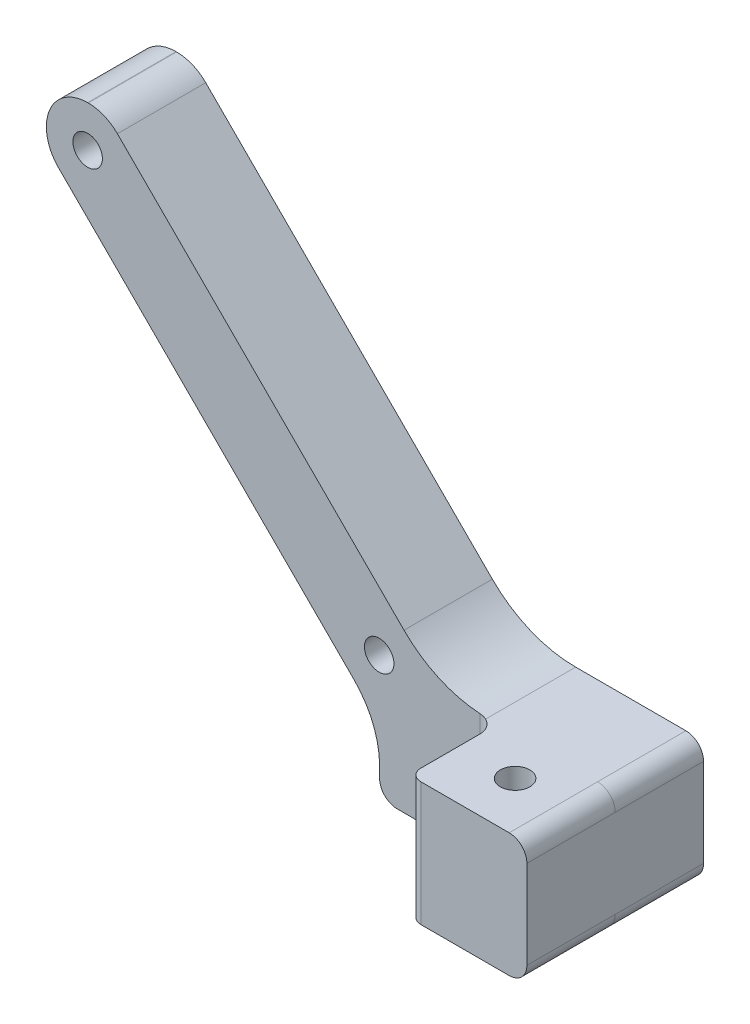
ISO-10303-21;
HEADER;
FILE_DESCRIPTION(('STEP AP214'),'2;1');
FILE_NAME('part.step','',(''),(''),'','','');
FILE_SCHEMA(('AUTOMOTIVE_DESIGN { 1 0 10303 214 1 1 1 1 }'));
ENDSEC;
DATA;
#1=APPLICATION_CONTEXT('core data for automotive mechanical design processes');
#2=APPLICATION_PROTOCOL_DEFINITION('international standard','automotive_design',2000,#1);
#3=PRODUCT_CONTEXT('',#1,'mechanical');
#4=PRODUCT('Part','Part','',(#3));
#5=PRODUCT_RELATED_PRODUCT_CATEGORY('part','',(#4));
#6=PRODUCT_DEFINITION_FORMATION('','',#4);
#7=PRODUCT_DEFINITION_CONTEXT('part definition',#1,'design');
#8=PRODUCT_DEFINITION('design','',#6,#7);
#9=PRODUCT_DEFINITION_SHAPE('','',#8);
#10=(LENGTH_UNIT() NAMED_UNIT(*) SI_UNIT(.MILLI.,.METRE.));
#11=(NAMED_UNIT(*) PLANE_ANGLE_UNIT() SI_UNIT($,.RADIAN.));
#12=(NAMED_UNIT(*) SI_UNIT($,.STERADIAN.) SOLID_ANGLE_UNIT());
#13=UNCERTAINTY_MEASURE_WITH_UNIT(LENGTH_MEASURE(1.E-05),#10,'distance_accuracy_value','');
#14=(GEOMETRIC_REPRESENTATION_CONTEXT(3) GLOBAL_UNCERTAINTY_ASSIGNED_CONTEXT((#13)) GLOBAL_UNIT_ASSIGNED_CONTEXT((#10,
#11,#12)) REPRESENTATION_CONTEXT('',''));
#15=CARTESIAN_POINT('',(0.,0.,0.));
#16=DIRECTION('',(0.,0.,1.));
#17=DIRECTION('',(1.,0.,0.));
#18=AXIS2_PLACEMENT_3D('',#15,#16,#17);
#19=CARTESIAN_POINT('',(-20.,21.,7.5));
#20=DIRECTION('',(0.,0.,-1.));
#21=DIRECTION('',(-1.,0.,0.));
#22=AXIS2_PLACEMENT_3D('',#19,#20,#21);
#23=PLANE('',#22);
#24=CARTESIAN_POINT('',(-69.568542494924,70.5685424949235,7.5));
#25=DIRECTION('',(0.,0.,1.));
#26=DIRECTION('',(1.,0.,0.));
#27=AXIS2_PLACEMENT_3D('',#24,#25,#26);
#28=CIRCLE('',#27,2.50000000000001);
#29=CARTESIAN_POINT('',(-67.068542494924,70.5685424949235,7.5));
#30=VERTEX_POINT('',#29);
#31=EDGE_CURVE('E467',#30,#30,#28,.T.);
#32=ORIENTED_EDGE('',*,*,#31,.F.);
#33=EDGE_LOOP('',(#32));
#34=FACE_BOUND('',#33,.T.);
#35=CARTESIAN_POINT('',(-20.0710678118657,21.0710678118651,7.5));
#36=DIRECTION('',(0.,0.,-1.));
#37=DIRECTION('',(-1.,0.,0.));
#38=AXIS2_PLACEMENT_3D('',#35,#36,#37);
#39=CIRCLE('',#38,2.5);
#40=CARTESIAN_POINT('',(-17.5710678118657,21.0710678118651,7.50000000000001));
#41=VERTEX_POINT('',#40);
#42=EDGE_CURVE('E270',#41,#41,#39,.T.);
#43=ORIENTED_EDGE('',*,*,#42,.T.);
#44=EDGE_LOOP('',(#43));
#45=FACE_BOUND('',#44,.T.);
#46=DIRECTION('',(1.,0.,0.));
#47=VECTOR('',#46,1.);
#48=CARTESIAN_POINT('',(-20.,0.,7.5));
#49=LINE('',#48,#47);
#50=CARTESIAN_POINT('',(-17.,0.,7.5));
#51=VERTEX_POINT('',#50);
#52=CARTESIAN_POINT('',(-3.,0.,7.5));
#53=VERTEX_POINT('',#52);
#54=EDGE_CURVE('E410',#51,#53,#49,.T.);
#55=ORIENTED_EDGE('',*,*,#54,.T.);
#56=DIRECTION('',(0.,-1.,0.));
#57=VECTOR('',#56,1.);
#58=CARTESIAN_POINT('',(-3.,21.,7.5));
#59=LINE('',#58,#57);
#60=CARTESIAN_POINT('',(-3.,21.0412764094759,7.5));
#61=VERTEX_POINT('',#60);
#62=EDGE_CURVE('E300',#53,#61,#59,.F.);
#63=ORIENTED_EDGE('',*,*,#62,.T.);
#64=CARTESIAN_POINT('',(-1.71572875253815,41.,7.5));
#65=DIRECTION('',(0.,0.,-1.));
#66=DIRECTION('',(-1.,0.,0.));
#67=AXIS2_PLACEMENT_3D('',#64,#65,#66);
#68=CIRCLE('',#67,20.);
#69=CARTESIAN_POINT('',(-15.857864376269,26.857864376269,7.5));
#70=VERTEX_POINT('',#69);
#71=EDGE_CURVE('E267',#61,#70,#68,.T.);
#72=ORIENTED_EDGE('',*,*,#71,.T.);
#73=DIRECTION('',(-0.707106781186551,0.707106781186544,0.));
#74=VECTOR('',#73,1.);
#75=CARTESIAN_POINT('',(-9.99999999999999,21.,7.5));
#76=LINE('',#75,#74);
#77=CARTESIAN_POINT('',(-64.5182899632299,75.5182899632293,7.5));
#78=VERTEX_POINT('',#77);
#79=EDGE_CURVE('E412',#70,#78,#76,.T.);
#80=ORIENTED_EDGE('',*,*,#79,.T.);
#81=CARTESIAN_POINT('',(-69.4680374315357,70.5685424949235,7.5));
#82=DIRECTION('',(0.,0.,-1.));
#83=DIRECTION('',(-1.,0.,0.));
#84=AXIS2_PLACEMENT_3D('',#81,#82,#83);
#85=CIRCLE('',#84,7.);
#86=CARTESIAN_POINT('',(-69.4680374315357,77.5685424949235,7.5));
#87=VERTEX_POINT('',#86);
#88=EDGE_CURVE('E250',#78,#87,#85,.F.);
#89=ORIENTED_EDGE('',*,*,#88,.T.);
#90=DIRECTION('',(1.,0.,0.));
#91=VECTOR('',#90,1.);
#92=CARTESIAN_POINT('',(-66.5685424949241,77.5685424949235,7.5));
#93=LINE('',#92,#91);
#94=CARTESIAN_POINT('',(-69.5685424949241,77.5685424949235,7.5));
#95=VERTEX_POINT('',#94);
#96=EDGE_CURVE('E481',#95,#87,#93,.T.);
#97=ORIENTED_EDGE('',*,*,#96,.F.);
#98=CARTESIAN_POINT('',(-69.5685424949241,70.5685424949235,7.5));
#99=DIRECTION('',(0.,0.,-1.));
#100=DIRECTION('',(-1.,0.,0.));
#101=AXIS2_PLACEMENT_3D('',#98,#99,#100);
#102=CIRCLE('',#101,7.);
#103=CARTESIAN_POINT('',(-76.5685424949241,70.5685424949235,7.5));
#104=VERTEX_POINT('',#103);
#105=EDGE_CURVE('E245',#95,#104,#102,.F.);
#106=ORIENTED_EDGE('',*,*,#105,.T.);
#107=DIRECTION('',(0.,1.,0.));
#108=VECTOR('',#107,1.);
#109=CARTESIAN_POINT('',(-76.5685424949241,77.5685424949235,7.5));
#110=LINE('',#109,#108);
#111=CARTESIAN_POINT('',(-76.5685424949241,70.4680374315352,7.5));
#112=VERTEX_POINT('',#111);
#113=EDGE_CURVE('E478',#112,#104,#110,.T.);
#114=ORIENTED_EDGE('',*,*,#113,.F.);
#115=CARTESIAN_POINT('',(-69.5685424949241,70.4680374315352,7.5));
#116=DIRECTION('',(0.,0.,-1.));
#117=DIRECTION('',(-1.,0.,0.));
#118=AXIS2_PLACEMENT_3D('',#115,#116,#117);
#119=CIRCLE('',#118,7.);
#120=CARTESIAN_POINT('',(-74.5182899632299,65.5182899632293,7.5));
#121=VERTEX_POINT('',#120);
#122=EDGE_CURVE('E247',#112,#121,#119,.F.);
#123=ORIENTED_EDGE('',*,*,#122,.T.);
#124=DIRECTION('',(-0.707106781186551,0.707106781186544,0.));
#125=VECTOR('',#124,1.);
#126=CARTESIAN_POINT('',(-20.,11.,7.5));
#127=LINE('',#126,#125);
#128=CARTESIAN_POINT('',(-24.3933982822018,15.3933982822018,7.5));
#129=VERTEX_POINT('',#128);
#130=EDGE_CURVE('E476',#129,#121,#127,.T.);
#131=ORIENTED_EDGE('',*,*,#130,.F.);
#132=CARTESIAN_POINT('',(-35.,4.78679656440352,7.5));
#133=DIRECTION('',(0.,0.,-1.));
#134=DIRECTION('',(-1.,0.,0.));
#135=AXIS2_PLACEMENT_3D('',#132,#133,#134);
#136=CIRCLE('',#135,15.);
#137=CARTESIAN_POINT('',(-20.,4.78679656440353,7.5));
#138=VERTEX_POINT('',#137);
#139=EDGE_CURVE('E279',#129,#138,#136,.T.);
#140=ORIENTED_EDGE('',*,*,#139,.T.);
#141=DIRECTION('',(0.,-1.,0.));
#142=VECTOR('',#141,1.);
#143=CARTESIAN_POINT('',(-20.,21.,7.5));
#144=LINE('',#143,#142);
#145=CARTESIAN_POINT('',(-20.,3.00000000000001,7.5));
#146=VERTEX_POINT('',#145);
#147=EDGE_CURVE('E416',#138,#146,#144,.T.);
#148=ORIENTED_EDGE('',*,*,#147,.T.);
#149=CARTESIAN_POINT('',(-17.,3.,7.5));
#150=DIRECTION('',(0.,0.,-1.));
#151=DIRECTION('',(-1.,0.,0.));
#152=AXIS2_PLACEMENT_3D('',#149,#150,#151);
#153=CIRCLE('',#152,3.);
#154=EDGE_CURVE('E219',#146,#51,#153,.F.);
#155=ORIENTED_EDGE('',*,*,#154,.T.);
#156=EDGE_LOOP('',(#55,#63,#72,#80,#89,#97,#106,#114,#123,#131,#140,#148,#155));
#157=FACE_BOUND('',#156,.T.);
#158=ADVANCED_FACE('F34',(#34,#45,#157),#23,.F.);
#159=CARTESIAN_POINT('',(-20.,21.,-7.5));
#160=DIRECTION('',(1.,0.,0.));
#161=DIRECTION('',(0.,0.,-1.));
#162=AXIS2_PLACEMENT_3D('',#159,#160,#161);
#163=PLANE('',#162);
#164=ORIENTED_EDGE('',*,*,#147,.F.);
#165=DIRECTION('',(0.,0.,1.));
#166=VECTOR('',#165,1.);
#167=CARTESIAN_POINT('',(-20.,4.78679656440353,-7.5));
#168=LINE('',#167,#166);
#169=CARTESIAN_POINT('',(-20.,4.78679656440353,-7.5));
#170=VERTEX_POINT('',#169);
#171=EDGE_CURVE('E277',#138,#170,#168,.F.);
#172=ORIENTED_EDGE('',*,*,#171,.T.);
#173=DIRECTION('',(0.,-1.,0.));
#174=VECTOR('',#173,1.);
#175=CARTESIAN_POINT('',(-20.,21.,-7.5));
#176=LINE('',#175,#174);
#177=CARTESIAN_POINT('',(-20.,3.00000000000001,-7.5));
#178=VERTEX_POINT('',#177);
#179=EDGE_CURVE('E203',#170,#178,#176,.T.);
#180=ORIENTED_EDGE('',*,*,#179,.T.);
#181=DIRECTION('',(0.,0.,1.));
#182=VECTOR('',#181,1.);
#183=CARTESIAN_POINT('',(-20.,3.,-7.5));
#184=LINE('',#183,#182);
#185=EDGE_CURVE('E226',#178,#146,#184,.T.);
#186=ORIENTED_EDGE('',*,*,#185,.T.);
#187=EDGE_LOOP('',(#164,#172,#180,#186));
#188=FACE_BOUND('',#187,.T.);
#189=ADVANCED_FACE('F346',(#188),#163,.F.);
#190=CARTESIAN_POINT('',(20.,21.,-7.5));
#191=DIRECTION('',(-1.,0.,0.));
#192=DIRECTION('',(0.,0.,1.));
#193=AXIS2_PLACEMENT_3D('',#190,#191,#192);
#194=PLANE('',#193);
#195=DIRECTION('',(0.,0.,-1.));
#196=VECTOR('',#195,1.);
#197=CARTESIAN_POINT('',(20.,18.,7.5));
#198=LINE('',#197,#196);
#199=CARTESIAN_POINT('',(20.,18.,-7.5));
#200=VERTEX_POINT('',#199);
#201=CARTESIAN_POINT('',(20.,18.,7.5));
#202=VERTEX_POINT('',#201);
#203=EDGE_CURVE('E198',#200,#202,#198,.F.);
#204=ORIENTED_EDGE('',*,*,#203,.T.);
#205=DIRECTION('',(0.,0.,-1.));
#206=VECTOR('',#205,1.);
#207=CARTESIAN_POINT('',(20.,18.,22.5));
#208=LINE('',#207,#206);
#209=CARTESIAN_POINT('',(20.,18.,22.5));
#210=VERTEX_POINT('',#209);
#211=EDGE_CURVE('E288',#202,#210,#208,.F.);
#212=ORIENTED_EDGE('',*,*,#211,.T.);
#213=DIRECTION('',(0.,1.,0.));
#214=VECTOR('',#213,1.);
#215=CARTESIAN_POINT('',(20.,0.,22.5));
#216=LINE('',#215,#214);
#217=CARTESIAN_POINT('',(20.,3.,22.5));
#218=VERTEX_POINT('',#217);
#219=EDGE_CURVE('E453',#218,#210,#216,.T.);
#220=ORIENTED_EDGE('',*,*,#219,.F.);
#221=DIRECTION('',(0.,0.,-1.));
#222=VECTOR('',#221,1.);
#223=CARTESIAN_POINT('',(20.,3.,-7.5));
#224=LINE('',#223,#222);
#225=CARTESIAN_POINT('',(20.,3.00000000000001,7.5));
#226=VERTEX_POINT('',#225);
#227=EDGE_CURVE('E286',#218,#226,#224,.T.);
#228=ORIENTED_EDGE('',*,*,#227,.T.);
#229=DIRECTION('',(0.,0.,-1.));
#230=VECTOR('',#229,1.);
#231=CARTESIAN_POINT('',(20.,3.,-7.5));
#232=LINE('',#231,#230);
#233=CARTESIAN_POINT('',(20.,3.00000000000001,-7.5));
#234=VERTEX_POINT('',#233);
#235=EDGE_CURVE('E202',#226,#234,#232,.T.);
#236=ORIENTED_EDGE('',*,*,#235,.T.);
#237=DIRECTION('',(0.,-1.,0.));
#238=VECTOR('',#237,1.);
#239=CARTESIAN_POINT('',(20.,21.,-7.5));
#240=LINE('',#239,#238);
#241=EDGE_CURVE('E185',#200,#234,#240,.T.);
#242=ORIENTED_EDGE('',*,*,#241,.F.);
#243=EDGE_LOOP('',(#204,#212,#220,#228,#236,#242));
#244=FACE_BOUND('',#243,.T.);
#245=ADVANCED_FACE('F197',(#244),#194,.F.);
#246=CARTESIAN_POINT('',(-20.,21.,-7.5));
#247=DIRECTION('',(0.,0.,1.));
#248=DIRECTION('',(1.,0.,0.));
#249=AXIS2_PLACEMENT_3D('',#246,#247,#248);
#250=PLANE('',#249);
#251=CARTESIAN_POINT('',(-20.0710678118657,21.0710678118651,-7.5));
#252=DIRECTION('',(0.,0.,1.));
#253=DIRECTION('',(1.,0.,0.));
#254=AXIS2_PLACEMENT_3D('',#251,#252,#253);
#255=CIRCLE('',#254,2.5);
#256=CARTESIAN_POINT('',(-17.5710678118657,21.0710678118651,-7.5));
#257=VERTEX_POINT('',#256);
#258=EDGE_CURVE('E273',#257,#257,#255,.T.);
#259=ORIENTED_EDGE('',*,*,#258,.T.);
#260=EDGE_LOOP('',(#259));
#261=FACE_BOUND('',#260,.T.);
#262=CARTESIAN_POINT('',(-69.568542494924,70.5685424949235,-7.5));
#263=DIRECTION('',(0.,0.,1.));
#264=DIRECTION('',(1.,0.,0.));
#265=AXIS2_PLACEMENT_3D('',#262,#263,#264);
#266=CIRCLE('',#265,2.50000000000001);
#267=CARTESIAN_POINT('',(-67.068542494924,70.5685424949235,-7.5));
#268=VERTEX_POINT('',#267);
#269=EDGE_CURVE('E468',#268,#268,#266,.T.);
#270=ORIENTED_EDGE('',*,*,#269,.T.);
#271=EDGE_LOOP('',(#270));
#272=FACE_BOUND('',#271,.T.);
#273=DIRECTION('',(-1.,0.,0.));
#274=VECTOR('',#273,1.);
#275=CARTESIAN_POINT('',(-66.5685424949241,77.5685424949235,-7.5));
#276=LINE('',#275,#274);
#277=CARTESIAN_POINT('',(-69.4680374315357,77.5685424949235,-7.5));
#278=VERTEX_POINT('',#277);
#279=CARTESIAN_POINT('',(-69.5685424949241,77.5685424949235,-7.5));
#280=VERTEX_POINT('',#279);
#281=EDGE_CURVE('E399',#278,#280,#276,.T.);
#282=ORIENTED_EDGE('',*,*,#281,.F.);
#283=CARTESIAN_POINT('',(-69.4680374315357,70.5685424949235,-7.5));
#284=DIRECTION('',(0.,0.,1.));
#285=DIRECTION('',(1.,0.,0.));
#286=AXIS2_PLACEMENT_3D('',#283,#284,#285);
#287=CIRCLE('',#286,7.);
#288=CARTESIAN_POINT('',(-64.5182899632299,75.5182899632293,-7.5));
#289=VERTEX_POINT('',#288);
#290=EDGE_CURVE('E239',#278,#289,#287,.F.);
#291=ORIENTED_EDGE('',*,*,#290,.T.);
#292=DIRECTION('',(-0.707106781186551,0.707106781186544,0.));
#293=VECTOR('',#292,1.);
#294=CARTESIAN_POINT('',(-9.99999999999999,21.,-7.5));
#295=LINE('',#294,#293);
#296=CARTESIAN_POINT('',(-15.857864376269,26.857864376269,-7.5));
#297=VERTEX_POINT('',#296);
#298=EDGE_CURVE('E407',#297,#289,#295,.T.);
#299=ORIENTED_EDGE('',*,*,#298,.F.);
#300=CARTESIAN_POINT('',(-1.71572875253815,41.,-7.5));
#301=DIRECTION('',(0.,0.,1.));
#302=DIRECTION('',(1.,0.,0.));
#303=AXIS2_PLACEMENT_3D('',#300,#301,#302);
#304=CIRCLE('',#303,20.);
#305=CARTESIAN_POINT('',(-1.71572875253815,21.,-7.5));
#306=VERTEX_POINT('',#305);
#307=EDGE_CURVE('E265',#297,#306,#304,.T.);
#308=ORIENTED_EDGE('',*,*,#307,.T.);
#309=DIRECTION('',(-1.,0.,0.));
#310=VECTOR('',#309,1.);
#311=CARTESIAN_POINT('',(-20.,21.,-7.5));
#312=LINE('',#311,#310);
#313=CARTESIAN_POINT('',(17.,21.,-7.5));
#314=VERTEX_POINT('',#313);
#315=EDGE_CURVE('E187',#314,#306,#312,.T.);
#316=ORIENTED_EDGE('',*,*,#315,.F.);
#317=CARTESIAN_POINT('',(17.,18.,-7.5));
#318=DIRECTION('',(0.,0.,1.));
#319=DIRECTION('',(1.,0.,0.));
#320=AXIS2_PLACEMENT_3D('',#317,#318,#319);
#321=CIRCLE('',#320,3.);
#322=EDGE_CURVE('E181',#314,#200,#321,.F.);
#323=ORIENTED_EDGE('',*,*,#322,.T.);
#324=ORIENTED_EDGE('',*,*,#241,.T.);
#325=CARTESIAN_POINT('',(17.,3.,-7.5));
#326=DIRECTION('',(0.,0.,1.));
#327=DIRECTION('',(1.,0.,0.));
#328=AXIS2_PLACEMENT_3D('',#325,#326,#327);
#329=CIRCLE('',#328,3.);
#330=CARTESIAN_POINT('',(17.,0.,-7.5));
#331=VERTEX_POINT('',#330);
#332=EDGE_CURVE('E192',#234,#331,#329,.F.);
#333=ORIENTED_EDGE('',*,*,#332,.T.);
#334=DIRECTION('',(-1.,0.,0.));
#335=VECTOR('',#334,1.);
#336=CARTESIAN_POINT('',(-20.,0.,-7.5));
#337=LINE('',#336,#335);
#338=CARTESIAN_POINT('',(-17.,0.,-7.5));
#339=VERTEX_POINT('',#338);
#340=EDGE_CURVE('E406',#331,#339,#337,.T.);
#341=ORIENTED_EDGE('',*,*,#340,.T.);
#342=CARTESIAN_POINT('',(-17.,3.,-7.5));
#343=DIRECTION('',(0.,0.,1.));
#344=DIRECTION('',(1.,0.,0.));
#345=AXIS2_PLACEMENT_3D('',#342,#343,#344);
#346=CIRCLE('',#345,3.);
#347=EDGE_CURVE('E193',#339,#178,#346,.F.);
#348=ORIENTED_EDGE('',*,*,#347,.T.);
#349=ORIENTED_EDGE('',*,*,#179,.F.);
#350=CARTESIAN_POINT('',(-35.,4.78679656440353,-7.5));
#351=DIRECTION('',(0.,0.,1.));
#352=DIRECTION('',(1.,0.,0.));
#353=AXIS2_PLACEMENT_3D('',#350,#351,#352);
#354=CIRCLE('',#353,15.);
#355=CARTESIAN_POINT('',(-24.3933982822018,15.3933982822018,-7.5));
#356=VERTEX_POINT('',#355);
#357=EDGE_CURVE('E281',#170,#356,#354,.T.);
#358=ORIENTED_EDGE('',*,*,#357,.T.);
#359=DIRECTION('',(-0.707106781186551,0.707106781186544,0.));
#360=VECTOR('',#359,1.);
#361=CARTESIAN_POINT('',(-20.,11.,-7.5));
#362=LINE('',#361,#360);
#363=CARTESIAN_POINT('',(-74.5182899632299,65.5182899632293,-7.5));
#364=VERTEX_POINT('',#363);
#365=EDGE_CURVE('E474',#356,#364,#362,.T.);
#366=ORIENTED_EDGE('',*,*,#365,.T.);
#367=CARTESIAN_POINT('',(-69.5685424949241,70.4680374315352,-7.5));
#368=DIRECTION('',(0.,0.,1.));
#369=DIRECTION('',(1.,0.,0.));
#370=AXIS2_PLACEMENT_3D('',#367,#368,#369);
#371=CIRCLE('',#370,7.);
#372=CARTESIAN_POINT('',(-76.5685424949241,70.4680374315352,-7.5));
#373=VERTEX_POINT('',#372);
#374=EDGE_CURVE('E237',#364,#373,#371,.F.);
#375=ORIENTED_EDGE('',*,*,#374,.T.);
#376=DIRECTION('',(0.,-1.,0.));
#377=VECTOR('',#376,1.);
#378=CARTESIAN_POINT('',(-76.5685424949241,77.5685424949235,-7.5));
#379=LINE('',#378,#377);
#380=CARTESIAN_POINT('',(-76.5685424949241,70.5685424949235,-7.5));
#381=VERTEX_POINT('',#380);
#382=EDGE_CURVE('E401',#381,#373,#379,.T.);
#383=ORIENTED_EDGE('',*,*,#382,.F.);
#384=CARTESIAN_POINT('',(-69.5685424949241,70.5685424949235,-7.5));
#385=DIRECTION('',(0.,0.,1.));
#386=DIRECTION('',(1.,0.,0.));
#387=AXIS2_PLACEMENT_3D('',#384,#385,#386);
#388=CIRCLE('',#387,7.);
#389=EDGE_CURVE('E235',#381,#280,#388,.F.);
#390=ORIENTED_EDGE('',*,*,#389,.T.);
#391=EDGE_LOOP('',(#282,#291,#299,#308,#316,#323,#324,#333,#341,#348,#349,#358,#366,#375,#383,#390));
#392=FACE_BOUND('',#391,.T.);
#393=ADVANCED_FACE('F184',(#261,#272,#392),#250,.F.);
#394=CARTESIAN_POINT('',(0.,21.,0.));
#395=DIRECTION('',(0.,1.,0.));
#396=DIRECTION('',(0.,0.,1.));
#397=AXIS2_PLACEMENT_3D('',#394,#395,#396);
#398=PLANE('',#397);
#399=CARTESIAN_POINT('',(9.50000000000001,21.,14.));
#400=DIRECTION('',(0.,1.,0.));
#401=DIRECTION('',(0.,0.,1.));
#402=AXIS2_PLACEMENT_3D('',#399,#400,#401);
#403=CIRCLE('',#402,2.5);
#404=CARTESIAN_POINT('',(9.50000000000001,21.,11.5));
#405=VERTEX_POINT('',#404);
#406=EDGE_CURVE('E454',#405,#405,#403,.T.);
#407=ORIENTED_EDGE('',*,*,#406,.F.);
#408=EDGE_LOOP('',(#407));
#409=FACE_BOUND('',#408,.T.);
#410=DIRECTION('',(0.,0.,-1.));
#411=VECTOR('',#410,1.);
#412=CARTESIAN_POINT('',(0.,21.,22.5));
#413=LINE('',#412,#411);
#414=CARTESIAN_POINT('',(0.,21.,20.5));
#415=VERTEX_POINT('',#414);
#416=CARTESIAN_POINT('',(0.,21.,10.5));
#417=VERTEX_POINT('',#416);
#418=EDGE_CURVE('E274',#415,#417,#413,.T.);
#419=ORIENTED_EDGE('',*,*,#418,.F.);
#420=CARTESIAN_POINT('',(2.,21.,20.5));
#421=DIRECTION('',(0.,1.,0.));
#422=DIRECTION('',(0.,0.,1.));
#423=AXIS2_PLACEMENT_3D('',#420,#421,#422);
#424=CIRCLE('',#423,2.);
#425=CARTESIAN_POINT('',(2.,21.,22.5));
#426=VERTEX_POINT('',#425);
#427=EDGE_CURVE('E11',#415,#426,#424,.T.);
#428=ORIENTED_EDGE('',*,*,#427,.T.);
#429=DIRECTION('',(-1.,0.,0.));
#430=VECTOR('',#429,1.);
#431=CARTESIAN_POINT('',(20.,21.,22.5));
#432=LINE('',#431,#430);
#433=CARTESIAN_POINT('',(17.,21.,22.5));
#434=VERTEX_POINT('',#433);
#435=EDGE_CURVE('E449',#434,#426,#432,.T.);
#436=ORIENTED_EDGE('',*,*,#435,.F.);
#437=DIRECTION('',(0.,0.,-1.));
#438=VECTOR('',#437,1.);
#439=CARTESIAN_POINT('',(17.,21.,7.5));
#440=LINE('',#439,#438);
#441=CARTESIAN_POINT('',(17.,21.,7.5));
#442=VERTEX_POINT('',#441);
#443=EDGE_CURVE('E283',#434,#442,#440,.T.);
#444=ORIENTED_EDGE('',*,*,#443,.T.);
#445=DIRECTION('',(0.,0.,-1.));
#446=VECTOR('',#445,1.);
#447=CARTESIAN_POINT('',(17.,21.,-7.5));
#448=LINE('',#447,#446);
#449=EDGE_CURVE('E224',#442,#314,#448,.T.);
#450=ORIENTED_EDGE('',*,*,#449,.T.);
#451=ORIENTED_EDGE('',*,*,#315,.T.);
#452=DIRECTION('',(0.,0.,-1.));
#453=VECTOR('',#452,1.);
#454=CARTESIAN_POINT('',(-1.71572875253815,21.,7.5));
#455=LINE('',#454,#453);
#456=CARTESIAN_POINT('',(-1.71572875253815,21.,7.78879226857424));
#457=VERTEX_POINT('',#456);
#458=EDGE_CURVE('E263',#306,#457,#455,.F.);
#459=ORIENTED_EDGE('',*,*,#458,.T.);
#460=CARTESIAN_POINT('',(-3.,21.,10.5));
#461=DIRECTION('',(0.,1.,0.));
#462=DIRECTION('',(0.,0.,1.));
#463=AXIS2_PLACEMENT_3D('',#460,#461,#462);
#464=CIRCLE('',#463,3.);
#465=EDGE_CURVE('E312',#457,#417,#464,.F.);
#466=ORIENTED_EDGE('',*,*,#465,.T.);
#467=EDGE_LOOP('',(#419,#428,#436,#444,#450,#451,#459,#466));
#468=FACE_BOUND('',#467,.T.);
#469=ADVANCED_FACE('F362',(#409,#468),#398,.T.);
#470=CARTESIAN_POINT('',(0.,0.,0.));
#471=DIRECTION('',(0.,1.,0.));
#472=DIRECTION('',(0.,0.,1.));
#473=AXIS2_PLACEMENT_3D('',#470,#471,#472);
#474=PLANE('',#473);
#475=CARTESIAN_POINT('',(9.50000000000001,0.,14.));
#476=DIRECTION('',(0.,-1.,0.));
#477=DIRECTION('',(0.,0.,-1.));
#478=AXIS2_PLACEMENT_3D('',#475,#476,#477);
#479=CIRCLE('',#478,2.5);
#480=CARTESIAN_POINT('',(9.50000000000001,0.,11.5));
#481=VERTEX_POINT('',#480);
#482=EDGE_CURVE('E459',#481,#481,#479,.T.);
#483=ORIENTED_EDGE('',*,*,#482,.F.);
#484=EDGE_LOOP('',(#483));
#485=FACE_BOUND('',#484,.T.);
#486=DIRECTION('',(1.,0.,0.));
#487=VECTOR('',#486,1.);
#488=CARTESIAN_POINT('',(0.,0.,22.5));
#489=LINE('',#488,#487);
#490=CARTESIAN_POINT('',(2.,0.,22.5));
#491=VERTEX_POINT('',#490);
#492=CARTESIAN_POINT('',(17.,0.,22.5));
#493=VERTEX_POINT('',#492);
#494=EDGE_CURVE('E447',#491,#493,#489,.T.);
#495=ORIENTED_EDGE('',*,*,#494,.F.);
#496=CARTESIAN_POINT('',(2.,0.,20.5));
#497=DIRECTION('',(0.,1.,0.));
#498=DIRECTION('',(0.,0.,1.));
#499=AXIS2_PLACEMENT_3D('',#496,#497,#498);
#500=CIRCLE('',#499,2.);
#501=CARTESIAN_POINT('',(0.,0.,20.5));
#502=VERTEX_POINT('',#501);
#503=EDGE_CURVE('E56',#491,#502,#500,.F.);
#504=ORIENTED_EDGE('',*,*,#503,.T.);
#505=DIRECTION('',(0.,0.,-1.));
#506=VECTOR('',#505,1.);
#507=CARTESIAN_POINT('',(0.,0.,22.5));
#508=LINE('',#507,#506);
#509=CARTESIAN_POINT('',(0.,0.,10.5));
#510=VERTEX_POINT('',#509);
#511=EDGE_CURVE('E432',#502,#510,#508,.T.);
#512=ORIENTED_EDGE('',*,*,#511,.T.);
#513=CARTESIAN_POINT('',(-3.,0.,10.5));
#514=DIRECTION('',(0.,1.,0.));
#515=DIRECTION('',(0.,0.,1.));
#516=AXIS2_PLACEMENT_3D('',#513,#514,#515);
#517=CIRCLE('',#516,3.);
#518=EDGE_CURVE('E302',#510,#53,#517,.T.);
#519=ORIENTED_EDGE('',*,*,#518,.T.);
#520=ORIENTED_EDGE('',*,*,#54,.F.);
#521=DIRECTION('',(0.,0.,1.));
#522=VECTOR('',#521,1.);
#523=CARTESIAN_POINT('',(-17.,0.,0.));
#524=LINE('',#523,#522);
#525=EDGE_CURVE('E215',#51,#339,#524,.F.);
#526=ORIENTED_EDGE('',*,*,#525,.T.);
#527=ORIENTED_EDGE('',*,*,#340,.F.);
#528=DIRECTION('',(0.,0.,-1.));
#529=VECTOR('',#528,1.);
#530=CARTESIAN_POINT('',(17.,0.,0.));
#531=LINE('',#530,#529);
#532=CARTESIAN_POINT('',(17.,0.,7.5));
#533=VERTEX_POINT('',#532);
#534=EDGE_CURVE('E217',#331,#533,#531,.F.);
#535=ORIENTED_EDGE('',*,*,#534,.T.);
#536=DIRECTION('',(0.,0.,-1.));
#537=VECTOR('',#536,1.);
#538=CARTESIAN_POINT('',(17.,0.,0.));
#539=LINE('',#538,#537);
#540=EDGE_CURVE('E294',#533,#493,#539,.F.);
#541=ORIENTED_EDGE('',*,*,#540,.T.);
#542=EDGE_LOOP('',(#495,#504,#512,#519,#520,#526,#527,#535,#541));
#543=FACE_BOUND('',#542,.T.);
#544=ADVANCED_FACE('F357',(#485,#543),#474,.F.);
#545=CARTESIAN_POINT('',(17.,3.,-7.5));
#546=DIRECTION('',(0.,0.,-1.));
#547=DIRECTION('',(-1.,0.,0.));
#548=AXIS2_PLACEMENT_3D('',#545,#546,#547);
#549=CYLINDRICAL_SURFACE('',#548,3.);
#550=CARTESIAN_POINT('',(17.,3.,7.5));
#551=DIRECTION('',(0.,0.,-1.));
#552=DIRECTION('',(-1.,0.,0.));
#553=AXIS2_PLACEMENT_3D('',#550,#551,#552);
#554=CIRCLE('',#553,3.);
#555=EDGE_CURVE('E222',#533,#226,#554,.F.);
#556=ORIENTED_EDGE('',*,*,#555,.F.);
#557=ORIENTED_EDGE('',*,*,#534,.F.);
#558=ORIENTED_EDGE('',*,*,#332,.F.);
#559=ORIENTED_EDGE('',*,*,#235,.F.);
#560=EDGE_LOOP('',(#556,#557,#558,#559));
#561=FACE_BOUND('',#560,.T.);
#562=ADVANCED_FACE('F366',(#561),#549,.T.);
#563=CARTESIAN_POINT('',(17.,18.,0.));
#564=DIRECTION('',(0.,0.,1.));
#565=DIRECTION('',(1.,0.,0.));
#566=AXIS2_PLACEMENT_3D('',#563,#564,#565);
#567=CYLINDRICAL_SURFACE('',#566,3.);
#568=CARTESIAN_POINT('',(17.,18.,7.5));
#569=DIRECTION('',(0.,0.,-1.));
#570=DIRECTION('',(-1.,0.,0.));
#571=AXIS2_PLACEMENT_3D('',#568,#569,#570);
#572=CIRCLE('',#571,3.);
#573=EDGE_CURVE('E206',#202,#442,#572,.F.);
#574=ORIENTED_EDGE('',*,*,#573,.F.);
#575=ORIENTED_EDGE('',*,*,#203,.F.);
#576=ORIENTED_EDGE('',*,*,#322,.F.);
#577=ORIENTED_EDGE('',*,*,#449,.F.);
#578=EDGE_LOOP('',(#574,#575,#576,#577));
#579=FACE_BOUND('',#578,.T.);
#580=ADVANCED_FACE('F205',(#579),#567,.T.);
#581=CARTESIAN_POINT('',(-17.,3.,-7.5));
#582=DIRECTION('',(0.,0.,1.));
#583=DIRECTION('',(1.,0.,0.));
#584=AXIS2_PLACEMENT_3D('',#581,#582,#583);
#585=CYLINDRICAL_SURFACE('',#584,3.);
#586=ORIENTED_EDGE('',*,*,#347,.F.);
#587=ORIENTED_EDGE('',*,*,#525,.F.);
#588=ORIENTED_EDGE('',*,*,#154,.F.);
#589=ORIENTED_EDGE('',*,*,#185,.F.);
#590=EDGE_LOOP('',(#586,#587,#588,#589));
#591=FACE_BOUND('',#590,.T.);
#592=ADVANCED_FACE('F372',(#591),#585,.T.);
#593=CARTESIAN_POINT('',(-56.5685424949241,77.5685424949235,0.));
#594=DIRECTION('',(0.,-1.,0.));
#595=DIRECTION('',(0.,0.,-1.));
#596=AXIS2_PLACEMENT_3D('',#593,#594,#595);
#597=PLANE('',#596);
#598=ORIENTED_EDGE('',*,*,#96,.T.);
#599=DIRECTION('',(0.,0.,-1.));
#600=VECTOR('',#599,1.);
#601=CARTESIAN_POINT('',(-69.4680374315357,77.5685424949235,-7.5));
#602=LINE('',#601,#600);
#603=EDGE_CURVE('E232',#87,#278,#602,.T.);
#604=ORIENTED_EDGE('',*,*,#603,.T.);
#605=ORIENTED_EDGE('',*,*,#281,.T.);
#606=DIRECTION('',(0.,0.,1.));
#607=VECTOR('',#606,1.);
#608=CARTESIAN_POINT('',(-69.5685424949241,77.5685424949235,7.5));
#609=LINE('',#608,#607);
#610=EDGE_CURVE('E229',#280,#95,#609,.T.);
#611=ORIENTED_EDGE('',*,*,#610,.T.);
#612=EDGE_LOOP('',(#598,#604,#605,#611));
#613=FACE_BOUND('',#612,.T.);
#614=ADVANCED_FACE('F375',(#613),#597,.F.);
#615=CARTESIAN_POINT('',(-9.99999999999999,21.,-7.5));
#616=DIRECTION('',(0.707106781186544,0.707106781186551,0.));
#617=DIRECTION('',(-0.707106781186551,0.707106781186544,0.));
#618=AXIS2_PLACEMENT_3D('',#615,#616,#617);
#619=PLANE('',#618);
#620=ORIENTED_EDGE('',*,*,#79,.F.);
#621=DIRECTION('',(0.,0.,-1.));
#622=VECTOR('',#621,1.);
#623=CARTESIAN_POINT('',(-15.857864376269,26.857864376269,-7.5));
#624=LINE('',#623,#622);
#625=EDGE_CURVE('E260',#70,#297,#624,.T.);
#626=ORIENTED_EDGE('',*,*,#625,.T.);
#627=ORIENTED_EDGE('',*,*,#298,.T.);
#628=DIRECTION('',(0.,0.,-1.));
#629=VECTOR('',#628,1.);
#630=CARTESIAN_POINT('',(-64.5182899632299,75.5182899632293,7.5));
#631=LINE('',#630,#629);
#632=EDGE_CURVE('E242',#289,#78,#631,.F.);
#633=ORIENTED_EDGE('',*,*,#632,.T.);
#634=EDGE_LOOP('',(#620,#626,#627,#633));
#635=FACE_BOUND('',#634,.T.);
#636=ADVANCED_FACE('F377',(#635),#619,.T.);
#637=CARTESIAN_POINT('',(-76.5685424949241,56.5685424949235,0.));
#638=DIRECTION('',(-1.,0.,0.));
#639=DIRECTION('',(0.,0.,1.));
#640=AXIS2_PLACEMENT_3D('',#637,#638,#639);
#641=PLANE('',#640);
#642=ORIENTED_EDGE('',*,*,#382,.T.);
#643=DIRECTION('',(0.,0.,1.));
#644=VECTOR('',#643,1.);
#645=CARTESIAN_POINT('',(-76.5685424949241,70.4680374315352,0.));
#646=LINE('',#645,#644);
#647=EDGE_CURVE('E254',#373,#112,#646,.T.);
#648=ORIENTED_EDGE('',*,*,#647,.T.);
#649=ORIENTED_EDGE('',*,*,#113,.T.);
#650=DIRECTION('',(0.,0.,1.));
#651=VECTOR('',#650,1.);
#652=CARTESIAN_POINT('',(-76.5685424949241,70.5685424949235,-7.5));
#653=LINE('',#652,#651);
#654=EDGE_CURVE('E252',#104,#381,#653,.F.);
#655=ORIENTED_EDGE('',*,*,#654,.T.);
#656=EDGE_LOOP('',(#642,#648,#649,#655));
#657=FACE_BOUND('',#656,.T.);
#658=ADVANCED_FACE('F384',(#657),#641,.T.);
#659=CARTESIAN_POINT('',(-20.,11.,-7.5));
#660=DIRECTION('',(-0.707106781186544,-0.707106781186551,0.));
#661=DIRECTION('',(0.707106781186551,-0.707106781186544,0.));
#662=AXIS2_PLACEMENT_3D('',#659,#660,#661);
#663=PLANE('',#662);
#664=ORIENTED_EDGE('',*,*,#365,.F.);
#665=DIRECTION('',(0.,0.,1.));
#666=VECTOR('',#665,1.);
#667=CARTESIAN_POINT('',(-24.3933982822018,15.3933982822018,-7.5));
#668=LINE('',#667,#666);
#669=EDGE_CURVE('E269',#356,#129,#668,.T.);
#670=ORIENTED_EDGE('',*,*,#669,.T.);
#671=ORIENTED_EDGE('',*,*,#130,.T.);
#672=DIRECTION('',(0.,0.,1.));
#673=VECTOR('',#672,1.);
#674=CARTESIAN_POINT('',(-74.5182899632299,65.5182899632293,-7.49999999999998));
#675=LINE('',#674,#673);
#676=EDGE_CURVE('E257',#121,#364,#675,.F.);
#677=ORIENTED_EDGE('',*,*,#676,.T.);
#678=EDGE_LOOP('',(#664,#670,#671,#677));
#679=FACE_BOUND('',#678,.T.);
#680=ADVANCED_FACE('F382',(#679),#663,.T.);
#681=CARTESIAN_POINT('',(-69.4680374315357,70.5685424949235,0.));
#682=DIRECTION('',(0.,0.,1.));
#683=DIRECTION('',(1.,0.,0.));
#684=AXIS2_PLACEMENT_3D('',#681,#682,#683);
#685=CYLINDRICAL_SURFACE('',#684,7.);
#686=ORIENTED_EDGE('',*,*,#88,.F.);
#687=ORIENTED_EDGE('',*,*,#632,.F.);
#688=ORIENTED_EDGE('',*,*,#290,.F.);
#689=ORIENTED_EDGE('',*,*,#603,.F.);
#690=EDGE_LOOP('',(#686,#687,#688,#689));
#691=FACE_BOUND('',#690,.T.);
#692=ADVANCED_FACE('F378',(#691),#685,.T.);
#693=CARTESIAN_POINT('',(-69.5685424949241,70.4680374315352,0.));
#694=DIRECTION('',(0.,0.,1.));
#695=DIRECTION('',(1.,0.,0.));
#696=AXIS2_PLACEMENT_3D('',#693,#694,#695);
#697=CYLINDRICAL_SURFACE('',#696,7.);
#698=ORIENTED_EDGE('',*,*,#374,.F.);
#699=ORIENTED_EDGE('',*,*,#676,.F.);
#700=ORIENTED_EDGE('',*,*,#122,.F.);
#701=ORIENTED_EDGE('',*,*,#647,.F.);
#702=EDGE_LOOP('',(#698,#699,#700,#701));
#703=FACE_BOUND('',#702,.T.);
#704=ADVANCED_FACE('F381',(#703),#697,.T.);
#705=CARTESIAN_POINT('',(-69.5685424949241,70.5685424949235,0.));
#706=DIRECTION('',(0.,0.,-1.));
#707=DIRECTION('',(-1.,0.,0.));
#708=AXIS2_PLACEMENT_3D('',#705,#706,#707);
#709=CYLINDRICAL_SURFACE('',#708,7.);
#710=ORIENTED_EDGE('',*,*,#389,.F.);
#711=ORIENTED_EDGE('',*,*,#654,.F.);
#712=ORIENTED_EDGE('',*,*,#105,.F.);
#713=ORIENTED_EDGE('',*,*,#610,.F.);
#714=EDGE_LOOP('',(#710,#711,#712,#713));
#715=FACE_BOUND('',#714,.T.);
#716=ADVANCED_FACE('F386',(#715),#709,.T.);
#717=CARTESIAN_POINT('',(-1.71572875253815,41.,-7.5));
#718=DIRECTION('',(0.,0.,1.));
#719=DIRECTION('',(1.,0.,0.));
#720=AXIS2_PLACEMENT_3D('',#717,#718,#719);
#721=CYLINDRICAL_SURFACE('',#720,20.);
#722=ORIENTED_EDGE('',*,*,#71,.F.);
#723=CARTESIAN_POINT('',(-3.,21.0412764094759,7.5));
#724=CARTESIAN_POINT('',(-2.915839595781,21.0358555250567,7.4999897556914));
#725=CARTESIAN_POINT('',(-2.83164310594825,21.0309775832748,7.50354100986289));
#726=CARTESIAN_POINT('',(-2.66375001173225,21.0223057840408,7.51771565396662));
#727=CARTESIAN_POINT('',(-2.58005366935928,21.0185124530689,7.5283424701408));
#728=CARTESIAN_POINT('',(-2.41534732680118,21.0120732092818,7.55635677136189));
#729=CARTESIAN_POINT('',(-2.33431624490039,21.0094074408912,7.57361606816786));
#730=CARTESIAN_POINT('',(-2.17397485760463,21.0050898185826,7.61477446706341));
#731=CARTESIAN_POINT('',(-2.09466354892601,21.0034373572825,7.63866957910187));
#732=CARTESIAN_POINT('',(-1.96545093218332,21.0014938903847,7.68350792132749));
#733=CARTESIAN_POINT('',(-1.91490110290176,21.0009293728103,7.70259457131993));
#734=CARTESIAN_POINT('',(-1.81459665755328,21.0001809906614,7.74359415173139));
#735=CARTESIAN_POINT('',(-1.76484880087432,20.9999994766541,7.76552366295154));
#736=CARTESIAN_POINT('',(-1.71572875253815,21.,7.78879226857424));
#737=B_SPLINE_CURVE_WITH_KNOTS('',3,(#723,#724,#725,#726,#727,#728,#729,#730,#731,#732,#733,
#734,#735,#736),.UNSPECIFIED.,.F.,.F.,(4,2,2,2,2,2,4),(0.,0.252930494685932,0.505983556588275,
0.754373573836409,1.00261455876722,1.16464863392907,1.32767428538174),.UNSPECIFIED.);
#738=EDGE_CURVE('E304',#61,#457,#737,.T.);
#739=ORIENTED_EDGE('',*,*,#738,.T.);
#740=ORIENTED_EDGE('',*,*,#458,.F.);
#741=ORIENTED_EDGE('',*,*,#307,.F.);
#742=ORIENTED_EDGE('',*,*,#625,.F.);
#743=EDGE_LOOP('',(#722,#739,#740,#741,#742));
#744=FACE_BOUND('',#743,.T.);
#745=ADVANCED_FACE('F314',(#744),#721,.F.);
#746=CARTESIAN_POINT('',(-69.568542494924,70.5685424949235,-7.5));
#747=DIRECTION('',(0.,0.,1.));
#748=DIRECTION('',(1.,0.,0.));
#749=AXIS2_PLACEMENT_3D('',#746,#747,#748);
#750=CYLINDRICAL_SURFACE('',#749,2.50000000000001);
#751=ORIENTED_EDGE('',*,*,#269,.F.);
#752=EDGE_LOOP('',(#751));
#753=FACE_BOUND('',#752,.T.);
#754=ORIENTED_EDGE('',*,*,#31,.T.);
#755=EDGE_LOOP('',(#754));
#756=FACE_BOUND('',#755,.T.);
#757=ADVANCED_FACE('F341',(#753,#756),#750,.F.);
#758=CARTESIAN_POINT('',(-20.0710678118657,21.0710678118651,-30.0502525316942));
#759=DIRECTION('',(0.,0.,1.));
#760=DIRECTION('',(1.,0.,0.));
#761=AXIS2_PLACEMENT_3D('',#758,#759,#760);
#762=CYLINDRICAL_SURFACE('',#761,2.5);
#763=CARTESIAN_POINT('',(-17.5710678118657,21.0710678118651,7.50000000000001));
#764=CARTESIAN_POINT('',(-17.5710678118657,21.0710678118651,7.34375000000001));
#765=CARTESIAN_POINT('',(-17.5710678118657,21.0710678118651,7.18750000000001));
#766=CARTESIAN_POINT('',(-17.5710678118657,21.0710678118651,6.87500000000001));
#767=CARTESIAN_POINT('',(-17.5710678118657,21.0710678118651,6.71875000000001));
#768=CARTESIAN_POINT('',(-17.5710678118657,21.0710678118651,6.40625000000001));
#769=CARTESIAN_POINT('',(-17.5710678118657,21.0710678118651,6.25000000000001));
#770=CARTESIAN_POINT('',(-17.5710678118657,21.0710678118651,5.93750000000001));
#771=CARTESIAN_POINT('',(-17.5710678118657,21.0710678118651,5.78125000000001));
#772=CARTESIAN_POINT('',(-17.5710678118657,21.0710678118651,5.46875000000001));
#773=CARTESIAN_POINT('',(-17.5710678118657,21.0710678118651,5.31250000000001));
#774=CARTESIAN_POINT('',(-17.5710678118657,21.0710678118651,5.00000000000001));
#775=CARTESIAN_POINT('',(-17.5710678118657,21.0710678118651,4.84375000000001));
#776=CARTESIAN_POINT('',(-17.5710678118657,21.0710678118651,4.53125000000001));
#777=CARTESIAN_POINT('',(-17.5710678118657,21.0710678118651,4.37500000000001));
#778=CARTESIAN_POINT('',(-17.5710678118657,21.0710678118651,4.06250000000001));
#779=CARTESIAN_POINT('',(-17.5710678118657,21.0710678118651,3.90625));
#780=CARTESIAN_POINT('',(-17.5710678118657,21.0710678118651,3.59375));
#781=CARTESIAN_POINT('',(-17.5710678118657,21.0710678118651,3.43750000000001));
#782=CARTESIAN_POINT('',(-17.5710678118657,21.0710678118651,3.125));
#783=CARTESIAN_POINT('',(-17.5710678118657,21.0710678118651,2.96875));
#784=CARTESIAN_POINT('',(-17.5710678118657,21.0710678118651,2.65625));
#785=CARTESIAN_POINT('',(-17.5710678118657,21.0710678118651,2.5));
#786=CARTESIAN_POINT('',(-17.5710678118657,21.0710678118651,2.1875));
#787=CARTESIAN_POINT('',(-17.5710678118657,21.0710678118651,2.03125));
#788=CARTESIAN_POINT('',(-17.5710678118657,21.0710678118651,1.71875));
#789=CARTESIAN_POINT('',(-17.5710678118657,21.0710678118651,1.5625));
#790=CARTESIAN_POINT('',(-17.5710678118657,21.0710678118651,1.25));
#791=CARTESIAN_POINT('',(-17.5710678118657,21.0710678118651,1.09375));
#792=CARTESIAN_POINT('',(-17.5710678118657,21.0710678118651,0.781250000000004));
#793=CARTESIAN_POINT('',(-17.5710678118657,21.0710678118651,0.625000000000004));
#794=CARTESIAN_POINT('',(-17.5710678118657,21.0710678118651,0.312500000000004));
#795=CARTESIAN_POINT('',(-17.5710678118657,21.0710678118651,0.156250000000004));
#796=CARTESIAN_POINT('',(-17.5710678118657,21.0710678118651,-0.156249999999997));
#797=CARTESIAN_POINT('',(-17.5710678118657,21.0710678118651,-0.312499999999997));
#798=CARTESIAN_POINT('',(-17.5710678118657,21.0710678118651,-0.624999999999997));
#799=CARTESIAN_POINT('',(-17.5710678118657,21.0710678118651,-0.781249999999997));
#800=CARTESIAN_POINT('',(-17.5710678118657,21.0710678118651,-1.09375));
#801=CARTESIAN_POINT('',(-17.5710678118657,21.0710678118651,-1.25));
#802=CARTESIAN_POINT('',(-17.5710678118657,21.0710678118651,-1.5625));
#803=CARTESIAN_POINT('',(-17.5710678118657,21.0710678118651,-1.71875));
#804=CARTESIAN_POINT('',(-17.5710678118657,21.0710678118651,-2.03125));
#805=CARTESIAN_POINT('',(-17.5710678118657,21.0710678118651,-2.1875));
#806=CARTESIAN_POINT('',(-17.5710678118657,21.0710678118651,-2.5));
#807=CARTESIAN_POINT('',(-17.5710678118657,21.0710678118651,-2.65625));
#808=CARTESIAN_POINT('',(-17.5710678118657,21.0710678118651,-2.96875));
#809=CARTESIAN_POINT('',(-17.5710678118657,21.0710678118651,-3.125));
#810=CARTESIAN_POINT('',(-17.5710678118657,21.0710678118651,-3.4375));
#811=CARTESIAN_POINT('',(-17.5710678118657,21.0710678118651,-3.59375));
#812=CARTESIAN_POINT('',(-17.5710678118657,21.0710678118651,-3.90625));
#813=CARTESIAN_POINT('',(-17.5710678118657,21.0710678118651,-4.0625));
#814=CARTESIAN_POINT('',(-17.5710678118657,21.0710678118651,-4.375));
#815=CARTESIAN_POINT('',(-17.5710678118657,21.0710678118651,-4.53125));
#816=CARTESIAN_POINT('',(-17.5710678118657,21.0710678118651,-4.84375));
#817=CARTESIAN_POINT('',(-17.5710678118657,21.0710678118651,-5.));
#818=CARTESIAN_POINT('',(-17.5710678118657,21.0710678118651,-5.3125));
#819=CARTESIAN_POINT('',(-17.5710678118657,21.0710678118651,-5.46875));
#820=CARTESIAN_POINT('',(-17.5710678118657,21.0710678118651,-5.78125));
#821=CARTESIAN_POINT('',(-17.5710678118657,21.0710678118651,-5.9375));
#822=CARTESIAN_POINT('',(-17.5710678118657,21.0710678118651,-6.25));
#823=CARTESIAN_POINT('',(-17.5710678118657,21.0710678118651,-6.40625));
#824=CARTESIAN_POINT('',(-17.5710678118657,21.0710678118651,-6.71875));
#825=CARTESIAN_POINT('',(-17.5710678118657,21.0710678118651,-6.875));
#826=CARTESIAN_POINT('',(-17.5710678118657,21.0710678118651,-7.1875));
#827=CARTESIAN_POINT('',(-17.5710678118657,21.0710678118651,-7.34375));
#828=CARTESIAN_POINT('',(-17.5710678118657,21.0710678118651,-7.5));
#829=B_SPLINE_CURVE_WITH_KNOTS('',3,(#763,#764,#765,#766,#767,#768,#769,#770,#771,#772,#773,
#774,#775,#776,#777,#778,#779,#780,#781,#782,#783,#784,#785,#786,#787,#788,#789,#790,#791,#792,
#793,#794,#795,#796,#797,#798,#799,#800,#801,#802,#803,#804,#805,#806,#807,#808,#809,#810,#811,
#812,#813,#814,#815,#816,#817,#818,#819,#820,#821,#822,#823,#824,#825,#826,#827,#828),
.UNSPECIFIED.,.F.,.F.,(4,2,2,2,2,2,2,2,2,2,2,2,2,2,2,2,2,2,2,2,2,2,2,2,2,2,2,2,2,2,2,2,4),(0.,
0.468749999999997,0.937500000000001,1.40625,1.875,2.34375,2.8125,3.28125,3.75,4.21875,4.6875,
5.15625,5.62500000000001,6.09375,6.5625,7.03125,7.5,7.96875,8.4375,8.90625,9.37500000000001,
9.84375000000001,10.3125,10.78125,11.25,11.71875,12.1875,12.65625,13.125,13.59375,14.0625,
14.53125,15.),.UNSPECIFIED.);
#830=EDGE_CURVE('BSEAM334',#41,#257,#829,.T.);
#831=ORIENTED_EDGE('',*,*,#42,.F.);
#832=ORIENTED_EDGE('',*,*,#258,.F.);
#833=ORIENTED_EDGE('',*,*,#830,.T.);
#834=ORIENTED_EDGE('',*,*,#830,.F.);
#835=EDGE_LOOP('',(#831,#833,#832,#834));
#836=FACE_BOUND('',#835,.T.);
#837=ADVANCED_FACE('F334',(#836),#762,.F.);
#838=CARTESIAN_POINT('',(-35.,4.78679656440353,-7.5));
#839=DIRECTION('',(0.,0.,1.));
#840=DIRECTION('',(1.,0.,0.));
#841=AXIS2_PLACEMENT_3D('',#838,#839,#840);
#842=CYLINDRICAL_SURFACE('',#841,15.);
#843=ORIENTED_EDGE('',*,*,#357,.F.);
#844=ORIENTED_EDGE('',*,*,#171,.F.);
#845=ORIENTED_EDGE('',*,*,#139,.F.);
#846=ORIENTED_EDGE('',*,*,#669,.F.);
#847=EDGE_LOOP('',(#843,#844,#845,#846));
#848=FACE_BOUND('',#847,.T.);
#849=ADVANCED_FACE('F331',(#848),#842,.F.);
#850=CARTESIAN_POINT('',(0.,21.,22.5));
#851=DIRECTION('',(1.,0.,0.));
#852=DIRECTION('',(0.,0.,-1.));
#853=AXIS2_PLACEMENT_3D('',#850,#851,#852);
#854=PLANE('',#853);
#855=ORIENTED_EDGE('',*,*,#511,.F.);
#856=DIRECTION('',(0.,-1.,0.));
#857=VECTOR('',#856,1.);
#858=CARTESIAN_POINT('',(0.,21.,20.5));
#859=LINE('',#858,#857);
#860=EDGE_CURVE('E42',#502,#415,#859,.F.);
#861=ORIENTED_EDGE('',*,*,#860,.T.);
#862=ORIENTED_EDGE('',*,*,#418,.T.);
#863=DIRECTION('',(0.,-1.,0.));
#864=VECTOR('',#863,1.);
#865=CARTESIAN_POINT('',(0.,0.,10.5));
#866=LINE('',#865,#864);
#867=EDGE_CURVE('E297',#417,#510,#866,.T.);
#868=ORIENTED_EDGE('',*,*,#867,.T.);
#869=EDGE_LOOP('',(#855,#861,#862,#868));
#870=FACE_BOUND('',#869,.T.);
#871=ADVANCED_FACE('F333',(#870),#854,.F.);
#872=CARTESIAN_POINT('',(0.,0.,22.5));
#873=DIRECTION('',(0.,0.,1.));
#874=DIRECTION('',(1.,0.,0.));
#875=AXIS2_PLACEMENT_3D('',#872,#873,#874);
#876=PLANE('',#875);
#877=ORIENTED_EDGE('',*,*,#435,.T.);
#878=DIRECTION('',(0.,-1.,0.));
#879=VECTOR('',#878,1.);
#880=CARTESIAN_POINT('',(2.,0.,22.5));
#881=LINE('',#880,#879);
#882=EDGE_CURVE('E441',#426,#491,#881,.T.);
#883=ORIENTED_EDGE('',*,*,#882,.T.);
#884=ORIENTED_EDGE('',*,*,#494,.T.);
#885=CARTESIAN_POINT('',(17.,3.,22.5));
#886=DIRECTION('',(0.,0.,1.));
#887=DIRECTION('',(1.,0.,0.));
#888=AXIS2_PLACEMENT_3D('',#885,#886,#887);
#889=CIRCLE('',#888,3.);
#890=EDGE_CURVE('E290',#493,#218,#889,.T.);
#891=ORIENTED_EDGE('',*,*,#890,.T.);
#892=ORIENTED_EDGE('',*,*,#219,.T.);
#893=CARTESIAN_POINT('',(17.,18.,22.5));
#894=DIRECTION('',(0.,0.,1.));
#895=DIRECTION('',(1.,0.,0.));
#896=AXIS2_PLACEMENT_3D('',#893,#894,#895);
#897=CIRCLE('',#896,3.);
#898=EDGE_CURVE('E292',#210,#434,#897,.T.);
#899=ORIENTED_EDGE('',*,*,#898,.T.);
#900=EDGE_LOOP('',(#877,#883,#884,#891,#892,#899));
#901=FACE_BOUND('',#900,.T.);
#902=ADVANCED_FACE('F329',(#901),#876,.T.);
#903=CARTESIAN_POINT('',(17.,18.,0.));
#904=DIRECTION('',(0.,0.,1.));
#905=DIRECTION('',(1.,0.,0.));
#906=AXIS2_PLACEMENT_3D('',#903,#904,#905);
#907=CYLINDRICAL_SURFACE('',#906,3.);
#908=ORIENTED_EDGE('',*,*,#898,.F.);
#909=ORIENTED_EDGE('',*,*,#211,.F.);
#910=ORIENTED_EDGE('',*,*,#573,.T.);
#911=ORIENTED_EDGE('',*,*,#443,.F.);
#912=EDGE_LOOP('',(#908,#909,#910,#911));
#913=FACE_BOUND('',#912,.T.);
#914=ADVANCED_FACE('F326',(#913),#907,.T.);
#915=CARTESIAN_POINT('',(17.,3.,-7.5));
#916=DIRECTION('',(0.,0.,-1.));
#917=DIRECTION('',(-1.,0.,0.));
#918=AXIS2_PLACEMENT_3D('',#915,#916,#917);
#919=CYLINDRICAL_SURFACE('',#918,3.);
#920=ORIENTED_EDGE('',*,*,#890,.F.);
#921=ORIENTED_EDGE('',*,*,#540,.F.);
#922=ORIENTED_EDGE('',*,*,#555,.T.);
#923=ORIENTED_EDGE('',*,*,#227,.F.);
#924=EDGE_LOOP('',(#920,#921,#922,#923));
#925=FACE_BOUND('',#924,.T.);
#926=ADVANCED_FACE('F322',(#925),#919,.T.);
#927=CARTESIAN_POINT('',(-3.,21.,10.5));
#928=DIRECTION('',(0.,1.,0.));
#929=DIRECTION('',(0.,0.,1.));
#930=AXIS2_PLACEMENT_3D('',#927,#928,#929);
#931=CYLINDRICAL_SURFACE('',#930,3.);
#932=ORIENTED_EDGE('',*,*,#738,.F.);
#933=ORIENTED_EDGE('',*,*,#62,.F.);
#934=ORIENTED_EDGE('',*,*,#518,.F.);
#935=ORIENTED_EDGE('',*,*,#867,.F.);
#936=ORIENTED_EDGE('',*,*,#465,.F.);
#937=EDGE_LOOP('',(#932,#933,#934,#935,#936));
#938=FACE_BOUND('',#937,.T.);
#939=ADVANCED_FACE('F318',(#938),#931,.F.);
#940=CARTESIAN_POINT('',(2.,0.,20.5));
#941=DIRECTION('',(0.,1.,0.));
#942=DIRECTION('',(0.,0.,1.));
#943=AXIS2_PLACEMENT_3D('',#940,#941,#942);
#944=CYLINDRICAL_SURFACE('',#943,2.);
#945=ORIENTED_EDGE('',*,*,#427,.F.);
#946=ORIENTED_EDGE('',*,*,#860,.F.);
#947=ORIENTED_EDGE('',*,*,#503,.F.);
#948=ORIENTED_EDGE('',*,*,#882,.F.);
#949=EDGE_LOOP('',(#945,#946,#947,#948));
#950=FACE_BOUND('',#949,.T.);
#951=ADVANCED_FACE('F36',(#950),#944,.T.);
#952=CARTESIAN_POINT('',(9.50000000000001,77.5685424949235,14.));
#953=DIRECTION('',(0.,-1.,0.));
#954=DIRECTION('',(0.,0.,-1.));
#955=AXIS2_PLACEMENT_3D('',#952,#953,#954);
#956=CYLINDRICAL_SURFACE('',#955,2.5);
#957=CARTESIAN_POINT('',(9.50000000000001,21.,11.5));
#958=CARTESIAN_POINT('',(9.50000000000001,20.78125,11.5));
#959=CARTESIAN_POINT('',(9.50000000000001,20.5625,11.5));
#960=CARTESIAN_POINT('',(9.50000000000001,20.125,11.5));
#961=CARTESIAN_POINT('',(9.50000000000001,19.90625,11.5));
#962=CARTESIAN_POINT('',(9.50000000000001,19.46875,11.5));
#963=CARTESIAN_POINT('',(9.50000000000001,19.25,11.5));
#964=CARTESIAN_POINT('',(9.50000000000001,18.8125,11.5));
#965=CARTESIAN_POINT('',(9.50000000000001,18.59375,11.5));
#966=CARTESIAN_POINT('',(9.50000000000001,18.15625,11.5));
#967=CARTESIAN_POINT('',(9.50000000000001,17.9375,11.5));
#968=CARTESIAN_POINT('',(9.50000000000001,17.5,11.5));
#969=CARTESIAN_POINT('',(9.50000000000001,17.28125,11.5));
#970=CARTESIAN_POINT('',(9.50000000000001,16.84375,11.5));
#971=CARTESIAN_POINT('',(9.50000000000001,16.625,11.5));
#972=CARTESIAN_POINT('',(9.50000000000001,16.1875,11.5));
#973=CARTESIAN_POINT('',(9.50000000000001,15.96875,11.5));
#974=CARTESIAN_POINT('',(9.50000000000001,15.53125,11.5));
#975=CARTESIAN_POINT('',(9.50000000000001,15.3125,11.5));
#976=CARTESIAN_POINT('',(9.50000000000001,14.875,11.5));
#977=CARTESIAN_POINT('',(9.50000000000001,14.65625,11.5));
#978=CARTESIAN_POINT('',(9.50000000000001,14.21875,11.5));
#979=CARTESIAN_POINT('',(9.50000000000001,14.,11.5));
#980=CARTESIAN_POINT('',(9.50000000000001,13.5625,11.5));
#981=CARTESIAN_POINT('',(9.50000000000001,13.34375,11.5));
#982=CARTESIAN_POINT('',(9.50000000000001,12.90625,11.5));
#983=CARTESIAN_POINT('',(9.50000000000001,12.6875,11.5));
#984=CARTESIAN_POINT('',(9.50000000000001,12.25,11.5));
#985=CARTESIAN_POINT('',(9.50000000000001,12.03125,11.5));
#986=CARTESIAN_POINT('',(9.50000000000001,11.59375,11.5));
#987=CARTESIAN_POINT('',(9.50000000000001,11.375,11.5));
#988=CARTESIAN_POINT('',(9.50000000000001,10.9375,11.5));
#989=CARTESIAN_POINT('',(9.50000000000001,10.71875,11.5));
#990=CARTESIAN_POINT('',(9.50000000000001,10.28125,11.5));
#991=CARTESIAN_POINT('',(9.50000000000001,10.0625,11.5));
#992=CARTESIAN_POINT('',(9.50000000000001,9.62500000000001,11.5));
#993=CARTESIAN_POINT('',(9.50000000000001,9.40625000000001,11.5));
#994=CARTESIAN_POINT('',(9.50000000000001,8.96875000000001,11.5));
#995=CARTESIAN_POINT('',(9.50000000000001,8.75000000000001,11.5));
#996=CARTESIAN_POINT('',(9.50000000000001,8.31250000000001,11.5));
#997=CARTESIAN_POINT('',(9.50000000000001,8.09375000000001,11.5));
#998=CARTESIAN_POINT('',(9.50000000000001,7.65625000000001,11.5));
#999=CARTESIAN_POINT('',(9.50000000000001,7.43750000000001,11.5));
#1000=CARTESIAN_POINT('',(9.50000000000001,7.00000000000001,11.5));
#1001=CARTESIAN_POINT('',(9.50000000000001,6.78125000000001,11.5));
#1002=CARTESIAN_POINT('',(9.50000000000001,6.34375000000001,11.5));
#1003=CARTESIAN_POINT('',(9.50000000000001,6.12500000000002,11.5));
#1004=CARTESIAN_POINT('',(9.50000000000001,5.68750000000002,11.5));
#1005=CARTESIAN_POINT('',(9.50000000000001,5.46875000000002,11.5));
#1006=CARTESIAN_POINT('',(9.50000000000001,5.03125000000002,11.5));
#1007=CARTESIAN_POINT('',(9.50000000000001,4.81250000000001,11.5));
#1008=CARTESIAN_POINT('',(9.50000000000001,4.37500000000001,11.5));
#1009=CARTESIAN_POINT('',(9.50000000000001,4.15625000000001,11.5));
#1010=CARTESIAN_POINT('',(9.50000000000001,3.71875000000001,11.5));
#1011=CARTESIAN_POINT('',(9.50000000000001,3.50000000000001,11.5));
#1012=CARTESIAN_POINT('',(9.50000000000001,3.06250000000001,11.5));
#1013=CARTESIAN_POINT('',(9.50000000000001,2.84375000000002,11.5));
#1014=CARTESIAN_POINT('',(9.50000000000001,2.40625000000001,11.5));
#1015=CARTESIAN_POINT('',(9.50000000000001,2.18750000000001,11.5));
#1016=CARTESIAN_POINT('',(9.50000000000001,1.75000000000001,11.5));
#1017=CARTESIAN_POINT('',(9.50000000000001,1.53125000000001,11.5));
#1018=CARTESIAN_POINT('',(9.50000000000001,1.09375000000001,11.5));
#1019=CARTESIAN_POINT('',(9.50000000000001,0.87500000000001,11.5));
#1020=CARTESIAN_POINT('',(9.50000000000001,0.437500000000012,11.5));
#1021=CARTESIAN_POINT('',(9.50000000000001,0.218750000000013,11.5));
#1022=CARTESIAN_POINT('',(9.50000000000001,0.,11.5));
#1023=B_SPLINE_CURVE_WITH_KNOTS('',3,(#957,#958,#959,#960,#961,#962,#963,#964,#965,#966,#967,
#968,#969,#970,#971,#972,#973,#974,#975,#976,#977,#978,#979,#980,#981,#982,#983,#984,#985,#986,
#987,#988,#989,#990,#991,#992,#993,#994,#995,#996,#997,#998,#999,#1000,#1001,#1002,#1003,#1004,
#1005,#1006,#1007,#1008,#1009,#1010,#1011,#1012,#1013,#1014,#1015,#1016,#1017,#1018,#1019,#1020,
#1021,#1022),.UNSPECIFIED.,.F.,.F.,(4,2,2,2,2,2,2,2,2,2,2,2,2,2,2,2,2,2,2,2,2,2,2,2,2,2,2,2,2,2,
2,2,4),(0.,0.656249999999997,1.3125,1.96875,2.625,3.28125,3.9375,4.59375,5.25,5.90624999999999,
6.56249999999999,7.21874999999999,7.87499999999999,8.53124999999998,9.18749999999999,
9.84374999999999,10.5,11.15625,11.8125,12.46875,13.125,13.78125,14.4375,15.09375,15.75,16.40625,
17.0625,17.71875,18.375,19.03125,19.6875,20.34375,21.),.UNSPECIFIED.);
#1024=EDGE_CURVE('BSEAM496',#405,#481,#1023,.T.);
#1025=ORIENTED_EDGE('',*,*,#406,.T.);
#1026=ORIENTED_EDGE('',*,*,#482,.T.);
#1027=ORIENTED_EDGE('',*,*,#1024,.T.);
#1028=ORIENTED_EDGE('',*,*,#1024,.F.);
#1029=EDGE_LOOP('',(#1025,#1027,#1026,#1028));
#1030=FACE_BOUND('',#1029,.T.);
#1031=ADVANCED_FACE('F496',(#1030),#956,.F.);
#1032=CLOSED_SHELL('',(#158,#189,#245,#393,#469,#544,#562,#580,#592,#614,#636,#658,#680,#692,
#704,#716,#745,#757,#837,#849,#871,#902,#914,#926,#939,#951,#1031));
#1033=MANIFOLD_SOLID_BREP('B2',#1032);
#1034=ADVANCED_BREP_SHAPE_REPRESENTATION('',(#18,#1033),#14);
#1035=SHAPE_DEFINITION_REPRESENTATION(#9,#1034);
ENDSEC;
END-ISO-10303-21;
